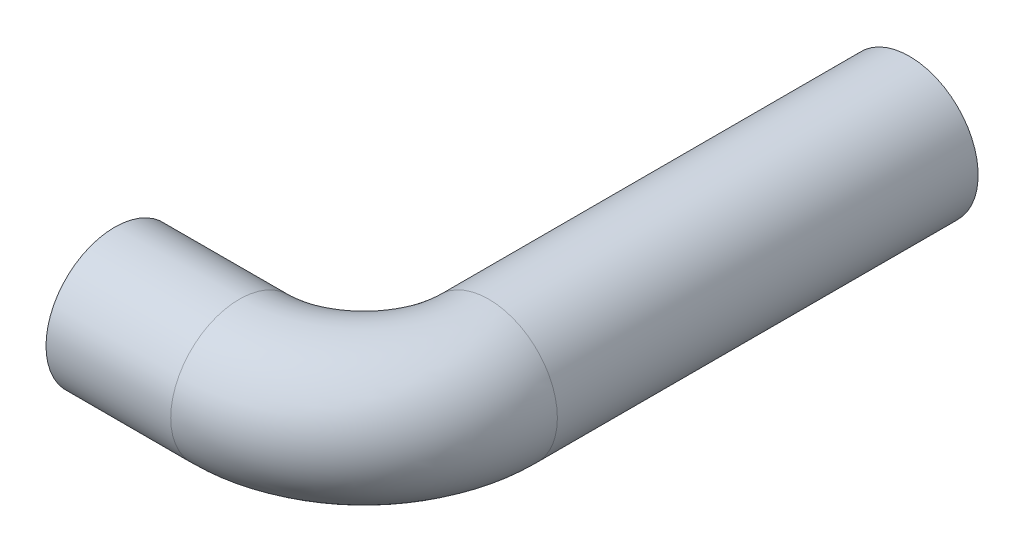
ISO-10303-21;
HEADER;
FILE_DESCRIPTION(('STEP AP214'),'2;1');
FILE_NAME('part.step','',(''),(''),'','','');
FILE_SCHEMA(('AUTOMOTIVE_DESIGN { 1 0 10303 214 1 1 1 1 }'));
ENDSEC;
DATA;
#1=APPLICATION_CONTEXT('core data for automotive mechanical design processes');
#2=APPLICATION_PROTOCOL_DEFINITION('international standard','automotive_design',2000,#1);
#3=PRODUCT_CONTEXT('',#1,'mechanical');
#4=PRODUCT('Part','Part','',(#3));
#5=PRODUCT_RELATED_PRODUCT_CATEGORY('part','',(#4));
#6=PRODUCT_DEFINITION_FORMATION('','',#4);
#7=PRODUCT_DEFINITION_CONTEXT('part definition',#1,'design');
#8=PRODUCT_DEFINITION('design','',#6,#7);
#9=PRODUCT_DEFINITION_SHAPE('','',#8);
#10=(LENGTH_UNIT() NAMED_UNIT(*) SI_UNIT(.MILLI.,.METRE.));
#11=(NAMED_UNIT(*) PLANE_ANGLE_UNIT() SI_UNIT($,.RADIAN.));
#12=(NAMED_UNIT(*) SI_UNIT($,.STERADIAN.) SOLID_ANGLE_UNIT());
#13=UNCERTAINTY_MEASURE_WITH_UNIT(LENGTH_MEASURE(1.E-05),#10,'distance_accuracy_value','');
#14=(GEOMETRIC_REPRESENTATION_CONTEXT(3) GLOBAL_UNCERTAINTY_ASSIGNED_CONTEXT((#13)) GLOBAL_UNIT_ASSIGNED_CONTEXT((#10,
#11,#12)) REPRESENTATION_CONTEXT('',''));
#15=CARTESIAN_POINT('',(0.,0.,0.));
#16=DIRECTION('',(0.,0.,1.));
#17=DIRECTION('',(1.,0.,0.));
#18=AXIS2_PLACEMENT_3D('',#15,#16,#17);
#19=CARTESIAN_POINT('',(6.,0.,-3.));
#20=DIRECTION('',(0.,0.,-1.));
#21=DIRECTION('',(-1.,0.,0.));
#22=AXIS2_PLACEMENT_3D('',#19,#20,#21);
#23=CYLINDRICAL_SURFACE('',#22,1.65);
#24=CARTESIAN_POINT('',(6.,0.,-3.));
#25=DIRECTION('',(0.,0.,-1.));
#26=DIRECTION('',(-1.,0.,0.));
#27=AXIS2_PLACEMENT_3D('',#24,#25,#26);
#28=CIRCLE('',#27,1.65);
#29=CARTESIAN_POINT('',(7.65,0.,-3.));
#30=VERTEX_POINT('',#29);
#31=EDGE_CURVE('E37',#30,#30,#28,.T.);
#32=ORIENTED_EDGE('',*,*,#31,.T.);
#33=EDGE_LOOP('',(#32));
#34=FACE_BOUND('',#33,.T.);
#35=CARTESIAN_POINT('',(6.,0.,-13.12));
#36=DIRECTION('',(0.,0.,-1.));
#37=DIRECTION('',(-1.,0.,0.));
#38=AXIS2_PLACEMENT_3D('',#35,#36,#37);
#39=CIRCLE('',#38,1.65);
#40=CARTESIAN_POINT('',(4.35,0.,-13.12));
#41=VERTEX_POINT('',#40);
#42=EDGE_CURVE('E10',#41,#41,#39,.T.);
#43=ORIENTED_EDGE('',*,*,#42,.F.);
#44=EDGE_LOOP('',(#43));
#45=FACE_BOUND('',#44,.T.);
#46=ADVANCED_FACE('F31',(#34,#45),#23,.T.);
#47=CARTESIAN_POINT('',(3.,0.,-3.));
#48=DIRECTION('',(0.,1.,0.));
#49=DIRECTION('',(0.,0.,1.));
#50=AXIS2_PLACEMENT_3D('',#47,#48,#49);
#51=TOROIDAL_SURFACE('',#50,3.,1.65);
#52=CARTESIAN_POINT('',(3.,0.,0.));
#53=DIRECTION('',(1.,0.,0.));
#54=DIRECTION('',(0.,0.,-1.));
#55=AXIS2_PLACEMENT_3D('',#52,#53,#54);
#56=CIRCLE('',#55,1.65);
#57=CARTESIAN_POINT('',(3.,0.,1.65));
#58=VERTEX_POINT('',#57);
#59=EDGE_CURVE('E41',#58,#58,#56,.T.);
#60=CARTESIAN_POINT('',(3.,0.,-3.));
#61=DIRECTION('',(0.,1.,0.));
#62=DIRECTION('',(0.,0.,1.));
#63=AXIS2_PLACEMENT_3D('',#60,#61,#62);
#64=CIRCLE('',#63,4.65);
#65=EDGE_CURVE('',#58,#30,#64,.T.);
#66=ORIENTED_EDGE('',*,*,#59,.T.);
#67=ORIENTED_EDGE('',*,*,#31,.F.);
#68=ORIENTED_EDGE('',*,*,#65,.T.);
#69=ORIENTED_EDGE('',*,*,#65,.F.);
#70=EDGE_LOOP('',(#66,#68,#67,#69));
#71=FACE_BOUND('',#70,.T.);
#72=ADVANCED_FACE('F63',(#71),#51,.T.);
#73=CARTESIAN_POINT('',(3.,0.,0.));
#74=DIRECTION('',(-1.,0.,0.));
#75=DIRECTION('',(0.,0.,1.));
#76=AXIS2_PLACEMENT_3D('',#73,#74,#75);
#77=CYLINDRICAL_SURFACE('',#76,1.65);
#78=ORIENTED_EDGE('',*,*,#59,.F.);
#79=EDGE_LOOP('',(#78));
#80=FACE_BOUND('',#79,.T.);
#81=CARTESIAN_POINT('',(0.,0.,0.));
#82=DIRECTION('',(1.,0.,0.));
#83=DIRECTION('',(0.,0.,-1.));
#84=AXIS2_PLACEMENT_3D('',#81,#82,#83);
#85=CIRCLE('',#84,1.65);
#86=CARTESIAN_POINT('',(0.,0.,-1.65));
#87=VERTEX_POINT('',#86);
#88=EDGE_CURVE('E45',#87,#87,#85,.T.);
#89=ORIENTED_EDGE('',*,*,#88,.T.);
#90=EDGE_LOOP('',(#89));
#91=FACE_BOUND('',#90,.T.);
#92=ADVANCED_FACE('F51',(#80,#91),#77,.T.);
#93=CARTESIAN_POINT('',(6.,0.,-13.12));
#94=DIRECTION('',(0.,0.,-1.));
#95=DIRECTION('',(-1.,0.,0.));
#96=AXIS2_PLACEMENT_3D('',#93,#94,#95);
#97=PLANE('',#96);
#98=ORIENTED_EDGE('',*,*,#42,.T.);
#99=EDGE_LOOP('',(#98));
#100=FACE_BOUND('',#99,.T.);
#101=ADVANCED_FACE('F55',(#100),#97,.T.);
#102=CARTESIAN_POINT('',(0.,0.,0.));
#103=DIRECTION('',(1.,0.,0.));
#104=DIRECTION('',(0.,0.,-1.));
#105=AXIS2_PLACEMENT_3D('',#102,#103,#104);
#106=PLANE('',#105);
#107=ORIENTED_EDGE('',*,*,#88,.F.);
#108=EDGE_LOOP('',(#107));
#109=FACE_BOUND('',#108,.T.);
#110=ADVANCED_FACE('F53',(#109),#106,.F.);
#111=CLOSED_SHELL('',(#46,#72,#92,#101,#110));
#112=MANIFOLD_SOLID_BREP('B2',#111);
#113=ADVANCED_BREP_SHAPE_REPRESENTATION('',(#18,#112),#14);
#114=SHAPE_DEFINITION_REPRESENTATION(#9,#113);
ENDSEC;
END-ISO-10303-21;
